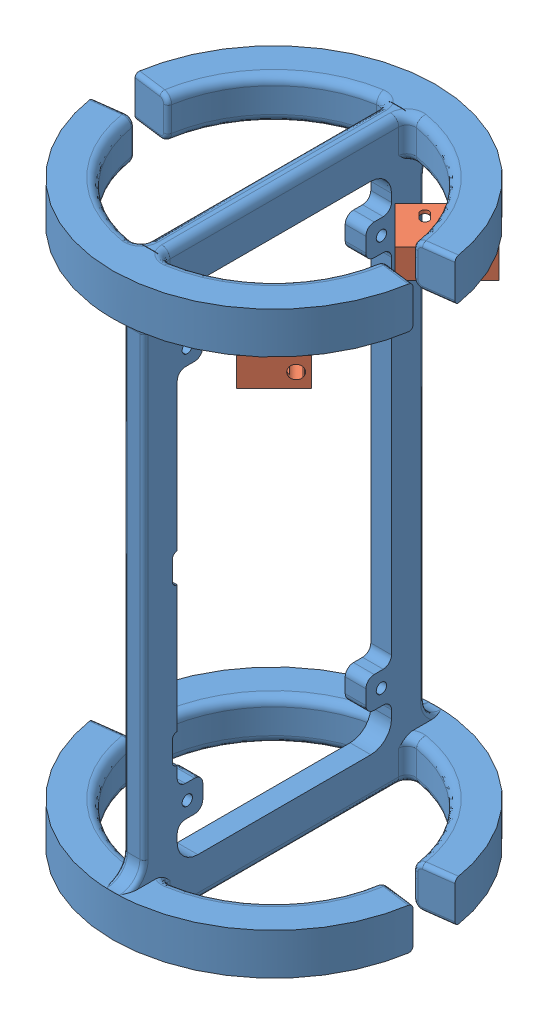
SolidWorks assembly Frame V3 (w RBF).SLDASM, configuration Default (file format 11000). Lengths in mm.
Overall size (98.36 178.26 99.06).
3 component instances, 2 part files, 8 mates.
Components (placement in the parent):
- 20190209_Avionics_FrameV2-1: 20190209_Avionics_FrameV2.SLDPRT [Default] at (12.1213 8.3347 162.6259) size (98.36 178.26 99.06)
- holderV2-2: holderV2.SLDPRT [Default] at (40.9418 164.5447 122.3444) x (-0.707107 0 0.707107) z (-0.707107 0 -0.707107) size (22.61 8.89 16.21)
- holderV2-3: holderV2.SLDPRT [Default] at (24.9569 164.5447 186.9226) x (0.707107 0 0.707107) z (-0.707107 0 0.707107) size (22.61 8.89 16.21)
Mates (geometry in assembly coordinates):
- Coincident10: coincident: plane of 20190209_Avionics_FrameV2-1 through (12.1213 173.4347 162.6259) normal (0 -1 0); plane of holderV2-2 through (40.9418 173.4347 122.3444) normal (0 1 0)
- Coincident22: coincident: plane of 20190209_Avionics_FrameV2-1 through (12.1213 173.4347 162.6259) normal (0 -1 0); plane of holderV2-3 through (24.9569 173.4347 186.9226) normal (0 1 0)
- Angle1: planar angle = 0.785398 rad: line of holderV2-3 through (36.4179 173.4347 175.4615) axis (-0.707107 0 0.707107); line of 20190209_Avionics_FrameV2-1 through (15.2963 173.4347 189.1659) axis (0 0 -1)
- Angle2: planar angle = 0.785398 rad: line of holderV2-2 through (24.9569 173.4347 138.3293) axis (0.707107 0 0.707107); line of 20190209_Avionics_FrameV2-1 through (15.2963 173.4347 189.1659) axis (0 0 -1)
- Coincident36: coincident: circle of 20190209_Avionics_FrameV2-1; point of holderV2-3
- Coincident37: coincident: circle of 20190209_Avionics_FrameV2-1; point of holderV2-3
- Coincident38: coincident: circle of 20190209_Avionics_FrameV2-1; point of holderV2-2
- Coincident39: coincident: circle of 20190209_Avionics_FrameV2-1; point of holderV2-2
